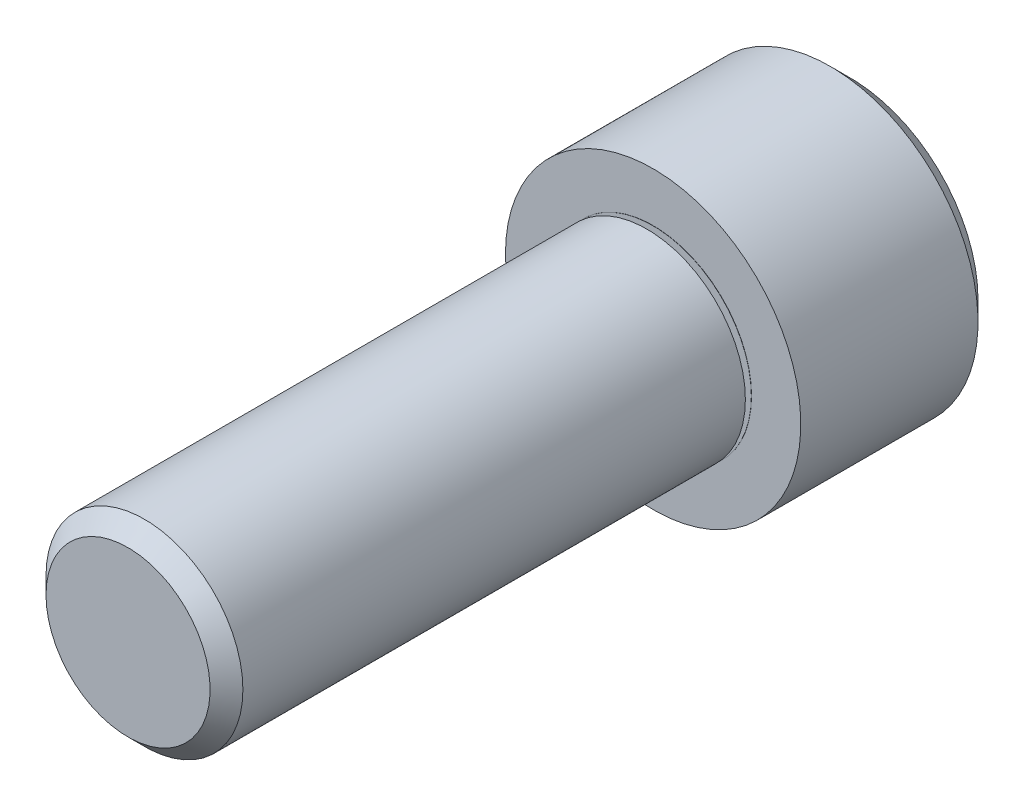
ISO-10303-21;
HEADER;
FILE_DESCRIPTION(('STEP AP214'),'2;1');
FILE_NAME('part.step','',(''),(''),'','','');
FILE_SCHEMA(('AUTOMOTIVE_DESIGN { 1 0 10303 214 1 1 1 1 }'));
ENDSEC;
DATA;
#1=APPLICATION_CONTEXT('core data for automotive mechanical design processes');
#2=APPLICATION_PROTOCOL_DEFINITION('international standard','automotive_design',2000,#1);
#3=PRODUCT_CONTEXT('',#1,'mechanical');
#4=PRODUCT('Part','Part','',(#3));
#5=PRODUCT_RELATED_PRODUCT_CATEGORY('part','',(#4));
#6=PRODUCT_DEFINITION_FORMATION('','',#4);
#7=PRODUCT_DEFINITION_CONTEXT('part definition',#1,'design');
#8=PRODUCT_DEFINITION('design','',#6,#7);
#9=PRODUCT_DEFINITION_SHAPE('','',#8);
#10=(LENGTH_UNIT() NAMED_UNIT(*) SI_UNIT(.MILLI.,.METRE.));
#11=(NAMED_UNIT(*) PLANE_ANGLE_UNIT() SI_UNIT($,.RADIAN.));
#12=(NAMED_UNIT(*) SI_UNIT($,.STERADIAN.) SOLID_ANGLE_UNIT());
#13=UNCERTAINTY_MEASURE_WITH_UNIT(LENGTH_MEASURE(1.E-05),#10,'distance_accuracy_value','');
#14=(GEOMETRIC_REPRESENTATION_CONTEXT(3) GLOBAL_UNCERTAINTY_ASSIGNED_CONTEXT((#13)) GLOBAL_UNIT_ASSIGNED_CONTEXT((#10,
#11,#12)) REPRESENTATION_CONTEXT('',''));
#15=CARTESIAN_POINT('',(0.,0.,0.));
#16=DIRECTION('',(0.,0.,1.));
#17=DIRECTION('',(1.,0.,0.));
#18=AXIS2_PLACEMENT_3D('',#15,#16,#17);
#19=CARTESIAN_POINT('',(0.,0.,-9.525));
#20=DIRECTION('',(0.,0.,1.));
#21=DIRECTION('',(1.,0.,0.));
#22=AXIS2_PLACEMENT_3D('',#19,#20,#21);
#23=PLANE('',#22);
#24=DIRECTION('',(-0.5,-0.866025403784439,0.));
#25=VECTOR('',#24,1.);
#26=CARTESIAN_POINT('',(4.57538541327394,0.,-9.525));
#27=LINE('',#26,#25);
#28=CARTESIAN_POINT('',(4.57538541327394,0.,-9.525));
#29=VERTEX_POINT('',#28);
#30=CARTESIAN_POINT('',(2.28769270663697,-3.96240000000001,-9.525));
#31=VERTEX_POINT('',#30);
#32=EDGE_CURVE('E145',#29,#31,#27,.T.);
#33=ORIENTED_EDGE('',*,*,#32,.F.);
#34=DIRECTION('',(0.499999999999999,-0.866025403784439,0.));
#35=VECTOR('',#34,1.);
#36=CARTESIAN_POINT('',(2.28769270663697,3.9624,-9.525));
#37=LINE('',#36,#35);
#38=CARTESIAN_POINT('',(2.28769270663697,3.9624,-9.525));
#39=VERTEX_POINT('',#38);
#40=EDGE_CURVE('E64',#39,#29,#37,.T.);
#41=ORIENTED_EDGE('',*,*,#40,.F.);
#42=DIRECTION('',(1.,0.,0.));
#43=VECTOR('',#42,1.);
#44=CARTESIAN_POINT('',(-2.28769270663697,3.9624,-9.525));
#45=LINE('',#44,#43);
#46=CARTESIAN_POINT('',(-2.28769270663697,3.9624,-9.525));
#47=VERTEX_POINT('',#46);
#48=EDGE_CURVE('E158',#47,#39,#45,.T.);
#49=ORIENTED_EDGE('',*,*,#48,.F.);
#50=DIRECTION('',(0.5,0.866025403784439,0.));
#51=VECTOR('',#50,1.);
#52=CARTESIAN_POINT('',(-4.57538541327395,0.,-9.525));
#53=LINE('',#52,#51);
#54=CARTESIAN_POINT('',(-4.57538541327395,0.,-9.525));
#55=VERTEX_POINT('',#54);
#56=EDGE_CURVE('E155',#55,#47,#53,.T.);
#57=ORIENTED_EDGE('',*,*,#56,.F.);
#58=DIRECTION('',(-0.5,0.866025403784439,0.));
#59=VECTOR('',#58,1.);
#60=CARTESIAN_POINT('',(-2.28769270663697,-3.96240000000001,-9.525));
#61=LINE('',#60,#59);
#62=CARTESIAN_POINT('',(-2.28769270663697,-3.96240000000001,-9.525));
#63=VERTEX_POINT('',#62);
#64=EDGE_CURVE('E112',#63,#55,#61,.T.);
#65=ORIENTED_EDGE('',*,*,#64,.F.);
#66=DIRECTION('',(-1.,0.,0.));
#67=VECTOR('',#66,1.);
#68=CARTESIAN_POINT('',(2.28769270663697,-3.96240000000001,-9.525));
#69=LINE('',#68,#67);
#70=EDGE_CURVE('E149',#31,#63,#69,.T.);
#71=ORIENTED_EDGE('',*,*,#70,.F.);
#72=EDGE_LOOP('',(#33,#41,#49,#57,#65,#71));
#73=FACE_BOUND('',#72,.T.);
#74=CARTESIAN_POINT('',(0.,0.,-9.525));
#75=DIRECTION('',(0.,0.,-1.));
#76=DIRECTION('',(-1.,0.,0.));
#77=AXIS2_PLACEMENT_3D('',#74,#75,#76);
#78=CIRCLE('',#77,6.19125000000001);
#79=CARTESIAN_POINT('',(-6.19125000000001,0.,-9.525));
#80=VERTEX_POINT('',#79);
#81=EDGE_CURVE('E164',#80,#80,#78,.T.);
#82=ORIENTED_EDGE('',*,*,#81,.T.);
#83=EDGE_LOOP('',(#82));
#84=FACE_BOUND('',#83,.T.);
#85=ADVANCED_FACE('F49',(#73,#84),#23,.F.);
#86=CARTESIAN_POINT('',(-3.96875000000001,0.,25.4));
#87=DIRECTION('',(0.,0.,-1.));
#88=DIRECTION('',(-1.,0.,0.));
#89=AXIS2_PLACEMENT_3D('',#86,#87,#88);
#90=PLANE('',#89);
#91=CARTESIAN_POINT('',(0.,0.,25.4));
#92=DIRECTION('',(0.,0.,-1.));
#93=DIRECTION('',(-1.,0.,0.));
#94=AXIS2_PLACEMENT_3D('',#91,#92,#93);
#95=CIRCLE('',#94,3.96875000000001);
#96=CARTESIAN_POINT('',(-3.96875000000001,0.,25.4));
#97=VERTEX_POINT('',#96);
#98=EDGE_CURVE('E11',#97,#97,#95,.T.);
#99=ORIENTED_EDGE('',*,*,#98,.F.);
#100=EDGE_LOOP('',(#99));
#101=FACE_BOUND('',#100,.T.);
#102=ADVANCED_FACE('F214',(#101),#90,.F.);
#103=CARTESIAN_POINT('',(0.,0.,25.4));
#104=DIRECTION('',(0.,0.,-1.));
#105=DIRECTION('',(-1.,0.,0.));
#106=AXIS2_PLACEMENT_3D('',#103,#104,#105);
#107=CONICAL_SURFACE('',#106,3.96875000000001,0.78539816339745);
#108=CARTESIAN_POINT('',(0.,0.,24.60625));
#109=DIRECTION('',(0.,0.,-1.));
#110=DIRECTION('',(-1.,0.,0.));
#111=AXIS2_PLACEMENT_3D('',#108,#109,#110);
#112=CIRCLE('',#111,4.76250000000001);
#113=CARTESIAN_POINT('',(-4.76250000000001,0.,24.60625));
#114=VERTEX_POINT('',#113);
#115=EDGE_CURVE('E57',#114,#114,#112,.T.);
#116=ORIENTED_EDGE('',*,*,#115,.F.);
#117=EDGE_LOOP('',(#116));
#118=FACE_BOUND('',#117,.T.);
#119=ORIENTED_EDGE('',*,*,#98,.T.);
#120=EDGE_LOOP('',(#119));
#121=FACE_BOUND('',#120,.T.);
#122=ADVANCED_FACE('F211',(#118,#121),#107,.T.);
#123=CARTESIAN_POINT('',(0.,0.,-10.585154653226));
#124=DIRECTION('',(0.,0.,-1.));
#125=DIRECTION('',(-1.,0.,0.));
#126=AXIS2_PLACEMENT_3D('',#123,#124,#125);
#127=CYLINDRICAL_SURFACE('',#126,4.76250000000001);
#128=CARTESIAN_POINT('',(0.,0.,0.298901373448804));
#129=DIRECTION('',(0.,0.,-1.));
#130=DIRECTION('',(-1.,0.,0.));
#131=AXIS2_PLACEMENT_3D('',#128,#129,#130);
#132=CIRCLE('',#131,4.7625);
#133=CARTESIAN_POINT('',(-4.7625,0.,0.298901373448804));
#134=VERTEX_POINT('',#133);
#135=EDGE_CURVE('E201',#134,#134,#132,.T.);
#136=ORIENTED_EDGE('',*,*,#135,.F.);
#137=EDGE_LOOP('',(#136));
#138=FACE_BOUND('',#137,.T.);
#139=ORIENTED_EDGE('',*,*,#115,.T.);
#140=EDGE_LOOP('',(#139));
#141=FACE_BOUND('',#140,.T.);
#142=ADVANCED_FACE('F209',(#138,#141),#127,.T.);
#143=CARTESIAN_POINT('',(0.,0.,0.298901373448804));
#144=DIRECTION('',(0.,0.,1.));
#145=DIRECTION('',(1.,0.,0.));
#146=AXIS2_PLACEMENT_3D('',#143,#144,#145);
#147=CONICAL_SURFACE('',#146,4.7625,1.22173047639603);
#148=CARTESIAN_POINT('',(0.,0.,0.0487938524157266));
#149=DIRECTION('',(0.,0.,-1.));
#150=DIRECTION('',(-1.,0.,0.));
#151=AXIS2_PLACEMENT_3D('',#148,#149,#150);
#152=CIRCLE('',#151,4.07533523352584);
#153=CARTESIAN_POINT('',(-4.07533523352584,0.,0.0487938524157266));
#154=VERTEX_POINT('',#153);
#155=EDGE_CURVE('E197',#154,#154,#152,.T.);
#156=ORIENTED_EDGE('',*,*,#155,.F.);
#157=EDGE_LOOP('',(#156));
#158=FACE_BOUND('',#157,.T.);
#159=ORIENTED_EDGE('',*,*,#135,.T.);
#160=EDGE_LOOP('',(#159));
#161=FACE_BOUND('',#160,.T.);
#162=ADVANCED_FACE('F226',(#158,#161),#147,.T.);
#163=CARTESIAN_POINT('',(0.,0.,0.0300000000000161));
#164=DIRECTION('',(0.,0.,-1.));
#165=DIRECTION('',(-1.,0.,0.));
#166=AXIS2_PLACEMENT_3D('',#163,#164,#165);
#167=TOROIDAL_SURFACE('',#166,4.08217563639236,0.0199999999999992);
#168=CARTESIAN_POINT('',(0.,0.,0.0100000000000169));
#169=DIRECTION('',(0.,0.,-1.));
#170=DIRECTION('',(-1.,0.,0.));
#171=AXIS2_PLACEMENT_3D('',#168,#169,#170);
#172=CIRCLE('',#171,4.08217563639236);
#173=CARTESIAN_POINT('',(-4.08217563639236,0.,0.0100000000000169));
#174=VERTEX_POINT('',#173);
#175=EDGE_CURVE('E193',#174,#174,#172,.T.);
#176=ORIENTED_EDGE('',*,*,#175,.F.);
#177=EDGE_LOOP('',(#176));
#178=FACE_BOUND('',#177,.T.);
#179=ORIENTED_EDGE('',*,*,#155,.T.);
#180=EDGE_LOOP('',(#179));
#181=FACE_BOUND('',#180,.T.);
#182=ADVANCED_FACE('F230',(#178,#181),#167,.F.);
#183=CARTESIAN_POINT('',(-4.7625,0.,0.0100000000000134));
#184=DIRECTION('',(0.,0.,-1.));
#185=DIRECTION('',(-1.,0.,0.));
#186=AXIS2_PLACEMENT_3D('',#183,#184,#185);
#187=PLANE('',#186);
#188=CARTESIAN_POINT('',(0.,0.,0.01000000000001));
#189=DIRECTION('',(0.,0.,-1.));
#190=DIRECTION('',(-1.,0.,0.));
#191=AXIS2_PLACEMENT_3D('',#188,#189,#190);
#192=CIRCLE('',#191,4.7625);
#193=CARTESIAN_POINT('',(-4.7625,0.,0.01000000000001));
#194=VERTEX_POINT('',#193);
#195=EDGE_CURVE('E189',#194,#194,#192,.T.);
#196=ORIENTED_EDGE('',*,*,#195,.F.);
#197=EDGE_LOOP('',(#196));
#198=FACE_BOUND('',#197,.T.);
#199=ORIENTED_EDGE('',*,*,#175,.T.);
#200=EDGE_LOOP('',(#199));
#201=FACE_BOUND('',#200,.T.);
#202=ADVANCED_FACE('F234',(#198,#201),#187,.F.);
#203=CARTESIAN_POINT('',(0.,0.,-10.585154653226));
#204=DIRECTION('',(0.,0.,-1.));
#205=DIRECTION('',(-1.,0.,0.));
#206=AXIS2_PLACEMENT_3D('',#203,#204,#205);
#207=CYLINDRICAL_SURFACE('',#206,4.7625);
#208=CARTESIAN_POINT('',(0.,0.,0.));
#209=DIRECTION('',(0.,0.,-1.));
#210=DIRECTION('',(-1.,0.,0.));
#211=AXIS2_PLACEMENT_3D('',#208,#209,#210);
#212=CIRCLE('',#211,4.7625);
#213=CARTESIAN_POINT('',(-4.7625,0.,0.));
#214=VERTEX_POINT('',#213);
#215=EDGE_CURVE('E185',#214,#214,#212,.T.);
#216=ORIENTED_EDGE('',*,*,#215,.F.);
#217=EDGE_LOOP('',(#216));
#218=FACE_BOUND('',#217,.T.);
#219=ORIENTED_EDGE('',*,*,#195,.T.);
#220=EDGE_LOOP('',(#219));
#221=FACE_BOUND('',#220,.T.);
#222=ADVANCED_FACE('F238',(#218,#221),#207,.T.);
#223=CARTESIAN_POINT('',(-7.14375000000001,0.,0.));
#224=DIRECTION('',(0.,0.,-1.));
#225=DIRECTION('',(-1.,0.,0.));
#226=AXIS2_PLACEMENT_3D('',#223,#224,#225);
#227=PLANE('',#226);
#228=CARTESIAN_POINT('',(0.,0.,0.));
#229=DIRECTION('',(0.,0.,-1.));
#230=DIRECTION('',(-1.,0.,0.));
#231=AXIS2_PLACEMENT_3D('',#228,#229,#230);
#232=CIRCLE('',#231,7.14375000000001);
#233=CARTESIAN_POINT('',(-7.14375000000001,0.,0.));
#234=VERTEX_POINT('',#233);
#235=EDGE_CURVE('E181',#234,#234,#232,.T.);
#236=ORIENTED_EDGE('',*,*,#235,.F.);
#237=EDGE_LOOP('',(#236));
#238=FACE_BOUND('',#237,.T.);
#239=ORIENTED_EDGE('',*,*,#215,.T.);
#240=EDGE_LOOP('',(#239));
#241=FACE_BOUND('',#240,.T.);
#242=ADVANCED_FACE('F242',(#238,#241),#227,.F.);
#243=CARTESIAN_POINT('',(0.,0.,-10.585154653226));
#244=DIRECTION('',(0.,0.,-1.));
#245=DIRECTION('',(-1.,0.,0.));
#246=AXIS2_PLACEMENT_3D('',#243,#244,#245);
#247=CYLINDRICAL_SURFACE('',#246,7.14375);
#248=CARTESIAN_POINT('',(0.,0.,-8.57249999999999));
#249=DIRECTION('',(0.,0.,-1.));
#250=DIRECTION('',(-1.,0.,0.));
#251=AXIS2_PLACEMENT_3D('',#248,#249,#250);
#252=CIRCLE('',#251,7.14375);
#253=CARTESIAN_POINT('',(-7.14375,0.,-8.57249999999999));
#254=VERTEX_POINT('',#253);
#255=EDGE_CURVE('E177',#254,#254,#252,.T.);
#256=ORIENTED_EDGE('',*,*,#255,.F.);
#257=EDGE_LOOP('',(#256));
#258=FACE_BOUND('',#257,.T.);
#259=ORIENTED_EDGE('',*,*,#235,.T.);
#260=EDGE_LOOP('',(#259));
#261=FACE_BOUND('',#260,.T.);
#262=ADVANCED_FACE('F246',(#258,#261),#247,.T.);
#263=CARTESIAN_POINT('',(0.,0.,-8.57249999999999));
#264=DIRECTION('',(0.,0.,1.));
#265=DIRECTION('',(1.,0.,0.));
#266=AXIS2_PLACEMENT_3D('',#263,#264,#265);
#267=CONICAL_SURFACE('',#266,7.14375,0.785398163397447);
#268=ORIENTED_EDGE('',*,*,#81,.F.);
#269=EDGE_LOOP('',(#268));
#270=FACE_BOUND('',#269,.T.);
#271=ORIENTED_EDGE('',*,*,#255,.T.);
#272=EDGE_LOOP('',(#271));
#273=FACE_BOUND('',#272,.T.);
#274=ADVANCED_FACE('F250',(#270,#273),#267,.T.);
#275=CARTESIAN_POINT('',(2.28769270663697,3.9624,-4.76249999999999));
#276=DIRECTION('',(0.866025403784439,0.499999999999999,0.));
#277=DIRECTION('',(-0.499999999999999,0.866025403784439,0.));
#278=AXIS2_PLACEMENT_3D('',#275,#276,#277);
#279=PLANE('',#278);
#280=ORIENTED_EDGE('',*,*,#40,.T.);
#281=DIRECTION('',(0.,0.,-1.));
#282=VECTOR('',#281,1.);
#283=CARTESIAN_POINT('',(4.57538541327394,0.,-4.76249999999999));
#284=LINE('',#283,#282);
#285=CARTESIAN_POINT('',(4.57538541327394,0.,-4.76249999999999));
#286=VERTEX_POINT('',#285);
#287=EDGE_CURVE('E94',#286,#29,#284,.T.);
#288=ORIENTED_EDGE('',*,*,#287,.F.);
#289=DIRECTION('',(0.499999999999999,-0.866025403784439,0.));
#290=VECTOR('',#289,1.);
#291=CARTESIAN_POINT('',(2.28769270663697,3.9624,-4.76249999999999));
#292=LINE('',#291,#290);
#293=CARTESIAN_POINT('',(2.28769270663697,3.9624,-4.76249999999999));
#294=VERTEX_POINT('',#293);
#295=EDGE_CURVE('E161',#294,#286,#292,.T.);
#296=ORIENTED_EDGE('',*,*,#295,.F.);
#297=DIRECTION('',(0.,0.,-1.));
#298=VECTOR('',#297,1.);
#299=CARTESIAN_POINT('',(2.28769270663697,3.9624,-4.76249999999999));
#300=LINE('',#299,#298);
#301=EDGE_CURVE('E72',#294,#39,#300,.T.);
#302=ORIENTED_EDGE('',*,*,#301,.T.);
#303=EDGE_LOOP('',(#280,#288,#296,#302));
#304=FACE_BOUND('',#303,.T.);
#305=ADVANCED_FACE('F254',(#304),#279,.F.);
#306=CARTESIAN_POINT('',(-2.28769270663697,3.9624,-4.76249999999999));
#307=DIRECTION('',(0.,1.,0.));
#308=DIRECTION('',(-1.,0.,0.));
#309=AXIS2_PLACEMENT_3D('',#306,#307,#308);
#310=PLANE('',#309);
#311=ORIENTED_EDGE('',*,*,#48,.T.);
#312=ORIENTED_EDGE('',*,*,#301,.F.);
#313=DIRECTION('',(1.,0.,0.));
#314=VECTOR('',#313,1.);
#315=CARTESIAN_POINT('',(-2.28769270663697,3.9624,-4.76249999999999));
#316=LINE('',#315,#314);
#317=CARTESIAN_POINT('',(-2.28769270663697,3.9624,-4.76249999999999));
#318=VERTEX_POINT('',#317);
#319=EDGE_CURVE('E126',#318,#294,#316,.T.);
#320=ORIENTED_EDGE('',*,*,#319,.F.);
#321=DIRECTION('',(0.,0.,-1.));
#322=VECTOR('',#321,1.);
#323=CARTESIAN_POINT('',(-2.28769270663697,3.9624,-4.76249999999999));
#324=LINE('',#323,#322);
#325=EDGE_CURVE('E117',#318,#47,#324,.T.);
#326=ORIENTED_EDGE('',*,*,#325,.T.);
#327=EDGE_LOOP('',(#311,#312,#320,#326));
#328=FACE_BOUND('',#327,.T.);
#329=ADVANCED_FACE('F258',(#328),#310,.F.);
#330=CARTESIAN_POINT('',(-4.57538541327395,0.,-4.76249999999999));
#331=DIRECTION('',(-0.866025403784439,0.5,0.));
#332=DIRECTION('',(-0.5,-0.866025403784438,0.));
#333=AXIS2_PLACEMENT_3D('',#330,#331,#332);
#334=PLANE('',#333);
#335=ORIENTED_EDGE('',*,*,#56,.T.);
#336=ORIENTED_EDGE('',*,*,#325,.F.);
#337=DIRECTION('',(0.5,0.866025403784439,0.));
#338=VECTOR('',#337,1.);
#339=CARTESIAN_POINT('',(-4.57538541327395,0.,-4.76249999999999));
#340=LINE('',#339,#338);
#341=CARTESIAN_POINT('',(-4.57538541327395,0.,-4.76249999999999));
#342=VERTEX_POINT('',#341);
#343=EDGE_CURVE('E121',#342,#318,#340,.T.);
#344=ORIENTED_EDGE('',*,*,#343,.F.);
#345=DIRECTION('',(0.,0.,-1.));
#346=VECTOR('',#345,1.);
#347=CARTESIAN_POINT('',(-4.57538541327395,0.,-4.76249999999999));
#348=LINE('',#347,#346);
#349=EDGE_CURVE('E105',#342,#55,#348,.T.);
#350=ORIENTED_EDGE('',*,*,#349,.T.);
#351=EDGE_LOOP('',(#335,#336,#344,#350));
#352=FACE_BOUND('',#351,.T.);
#353=ADVANCED_FACE('F122',(#352),#334,.F.);
#354=CARTESIAN_POINT('',(-2.28769270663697,-3.9624,-4.76249999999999));
#355=DIRECTION('',(-0.866025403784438,-0.5,0.));
#356=DIRECTION('',(0.5,-0.866025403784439,0.));
#357=AXIS2_PLACEMENT_3D('',#354,#355,#356);
#358=PLANE('',#357);
#359=ORIENTED_EDGE('',*,*,#64,.T.);
#360=ORIENTED_EDGE('',*,*,#349,.F.);
#361=DIRECTION('',(-0.5,0.866025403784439,0.));
#362=VECTOR('',#361,1.);
#363=CARTESIAN_POINT('',(-2.28769270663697,-3.9624,-4.76249999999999));
#364=LINE('',#363,#362);
#365=CARTESIAN_POINT('',(-2.28769270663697,-3.9624,-4.76249999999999));
#366=VERTEX_POINT('',#365);
#367=EDGE_CURVE('E109',#366,#342,#364,.T.);
#368=ORIENTED_EDGE('',*,*,#367,.F.);
#369=DIRECTION('',(0.,0.,-1.));
#370=VECTOR('',#369,1.);
#371=CARTESIAN_POINT('',(-2.28769270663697,-3.9624,-4.76249999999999));
#372=LINE('',#371,#370);
#373=EDGE_CURVE('E118',#366,#63,#372,.T.);
#374=ORIENTED_EDGE('',*,*,#373,.T.);
#375=EDGE_LOOP('',(#359,#360,#368,#374));
#376=FACE_BOUND('',#375,.T.);
#377=ADVANCED_FACE('F107',(#376),#358,.F.);
#378=CARTESIAN_POINT('',(2.28769270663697,-3.9624,-4.76249999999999));
#379=DIRECTION('',(0.,-1.,0.));
#380=DIRECTION('',(0.,0.,-1.));
#381=AXIS2_PLACEMENT_3D('',#378,#379,#380);
#382=PLANE('',#381);
#383=ORIENTED_EDGE('',*,*,#70,.T.);
#384=ORIENTED_EDGE('',*,*,#373,.F.);
#385=DIRECTION('',(-1.,0.,0.));
#386=VECTOR('',#385,1.);
#387=CARTESIAN_POINT('',(2.28769270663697,-3.9624,-4.76249999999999));
#388=LINE('',#387,#386);
#389=CARTESIAN_POINT('',(2.28769270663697,-3.9624,-4.76249999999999));
#390=VERTEX_POINT('',#389);
#391=EDGE_CURVE('E132',#390,#366,#388,.T.);
#392=ORIENTED_EDGE('',*,*,#391,.F.);
#393=DIRECTION('',(0.,0.,-1.));
#394=VECTOR('',#393,1.);
#395=CARTESIAN_POINT('',(2.28769270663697,-3.9624,-4.76249999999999));
#396=LINE('',#395,#394);
#397=EDGE_CURVE('E169',#390,#31,#396,.T.);
#398=ORIENTED_EDGE('',*,*,#397,.T.);
#399=EDGE_LOOP('',(#383,#384,#392,#398));
#400=FACE_BOUND('',#399,.T.);
#401=ADVANCED_FACE('F262',(#400),#382,.F.);
#402=CARTESIAN_POINT('',(4.57538541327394,0.,-4.76249999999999));
#403=DIRECTION('',(0.866025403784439,-0.5,0.));
#404=DIRECTION('',(0.5,0.866025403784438,0.));
#405=AXIS2_PLACEMENT_3D('',#402,#403,#404);
#406=PLANE('',#405);
#407=ORIENTED_EDGE('',*,*,#32,.T.);
#408=ORIENTED_EDGE('',*,*,#397,.F.);
#409=DIRECTION('',(-0.5,-0.866025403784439,0.));
#410=VECTOR('',#409,1.);
#411=CARTESIAN_POINT('',(4.57538541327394,0.,-4.76249999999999));
#412=LINE('',#411,#410);
#413=EDGE_CURVE('E137',#286,#390,#412,.T.);
#414=ORIENTED_EDGE('',*,*,#413,.F.);
#415=ORIENTED_EDGE('',*,*,#287,.T.);
#416=EDGE_LOOP('',(#407,#408,#414,#415));
#417=FACE_BOUND('',#416,.T.);
#418=ADVANCED_FACE('F259',(#417),#406,.F.);
#419=CARTESIAN_POINT('',(2.28769270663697,3.9624,-4.76249999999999));
#420=DIRECTION('',(0.,0.,1.));
#421=DIRECTION('',(1.,0.,0.));
#422=AXIS2_PLACEMENT_3D('',#419,#420,#421);
#423=PLANE('',#422);
#424=ORIENTED_EDGE('',*,*,#295,.T.);
#425=ORIENTED_EDGE('',*,*,#413,.T.);
#426=ORIENTED_EDGE('',*,*,#391,.T.);
#427=ORIENTED_EDGE('',*,*,#367,.T.);
#428=ORIENTED_EDGE('',*,*,#343,.T.);
#429=ORIENTED_EDGE('',*,*,#319,.T.);
#430=EDGE_LOOP('',(#424,#425,#426,#427,#428,#429));
#431=FACE_BOUND('',#430,.T.);
#432=ADVANCED_FACE('F129',(#431),#423,.F.);
#433=CLOSED_SHELL('',(#85,#102,#122,#142,#162,#182,#202,#222,#242,#262,#274,#305,#329,#353,#377,
#401,#418,#432));
#434=MANIFOLD_SOLID_BREP('B2',#433);
#435=ADVANCED_BREP_SHAPE_REPRESENTATION('',(#18,#434),#14);
#436=SHAPE_DEFINITION_REPRESENTATION(#9,#435);
ENDSEC;
END-ISO-10303-21;
